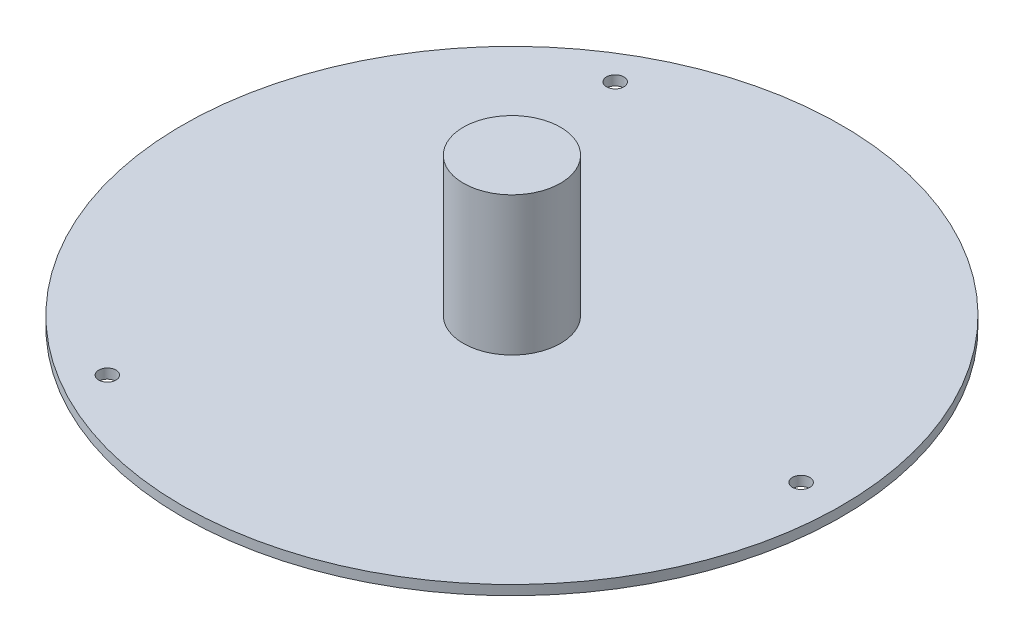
ISO-10303-21;
HEADER;
FILE_DESCRIPTION(('STEP AP214'),'2;1');
FILE_NAME('part.step','',(''),(''),'','','');
FILE_SCHEMA(('AUTOMOTIVE_DESIGN { 1 0 10303 214 1 1 1 1 }'));
ENDSEC;
DATA;
#1=APPLICATION_CONTEXT('core data for automotive mechanical design processes');
#2=APPLICATION_PROTOCOL_DEFINITION('international standard','automotive_design',2000,#1);
#3=PRODUCT_CONTEXT('',#1,'mechanical');
#4=PRODUCT('Part','Part','',(#3));
#5=PRODUCT_RELATED_PRODUCT_CATEGORY('part','',(#4));
#6=PRODUCT_DEFINITION_FORMATION('','',#4);
#7=PRODUCT_DEFINITION_CONTEXT('part definition',#1,'design');
#8=PRODUCT_DEFINITION('design','',#6,#7);
#9=PRODUCT_DEFINITION_SHAPE('','',#8);
#10=(LENGTH_UNIT() NAMED_UNIT(*) SI_UNIT(.MILLI.,.METRE.));
#11=(NAMED_UNIT(*) PLANE_ANGLE_UNIT() SI_UNIT($,.RADIAN.));
#12=(NAMED_UNIT(*) SI_UNIT($,.STERADIAN.) SOLID_ANGLE_UNIT());
#13=UNCERTAINTY_MEASURE_WITH_UNIT(LENGTH_MEASURE(1.E-05),#10,'distance_accuracy_value','');
#14=(GEOMETRIC_REPRESENTATION_CONTEXT(3) GLOBAL_UNCERTAINTY_ASSIGNED_CONTEXT((#13)) GLOBAL_UNIT_ASSIGNED_CONTEXT((#10,
#11,#12)) REPRESENTATION_CONTEXT('',''));
#15=CARTESIAN_POINT('',(0.,0.,0.));
#16=DIRECTION('',(0.,0.,1.));
#17=DIRECTION('',(1.,0.,0.));
#18=AXIS2_PLACEMENT_3D('',#15,#16,#17);
#19=CARTESIAN_POINT('',(0.,1.778,0.));
#20=DIRECTION('',(0.,1.,0.));
#21=DIRECTION('',(0.,0.,1.));
#22=AXIS2_PLACEMENT_3D('',#19,#20,#21);
#23=PLANE('',#22);
#24=CARTESIAN_POINT('',(0.,1.778,0.));
#25=DIRECTION('',(0.,1.,0.));
#26=DIRECTION('',(0.,0.,1.));
#27=AXIS2_PLACEMENT_3D('',#24,#25,#26);
#28=CIRCLE('',#27,60.325);
#29=CARTESIAN_POINT('',(0.,1.778,60.325));
#30=VERTEX_POINT('',#29);
#31=EDGE_CURVE('E10',#30,#30,#28,.T.);
#32=ORIENTED_EDGE('',*,*,#31,.T.);
#33=EDGE_LOOP('',(#32));
#34=FACE_BOUND('',#33,.T.);
#35=CARTESIAN_POINT('',(52.9345433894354,1.778,0.));
#36=DIRECTION('',(0.,1.,0.));
#37=DIRECTION('',(0.,0.,1.));
#38=AXIS2_PLACEMENT_3D('',#35,#36,#37);
#39=CIRCLE('',#38,1.5875);
#40=CARTESIAN_POINT('',(52.9345433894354,1.778,1.58749999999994));
#41=VERTEX_POINT('',#40);
#42=EDGE_CURVE('E43',#41,#41,#39,.T.);
#43=ORIENTED_EDGE('',*,*,#42,.F.);
#44=EDGE_LOOP('',(#43));
#45=FACE_BOUND('',#44,.T.);
#46=CARTESIAN_POINT('',(-27.574642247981,1.778,-46.482));
#47=DIRECTION('',(0.,1.,0.));
#48=DIRECTION('',(0.,0.,1.));
#49=AXIS2_PLACEMENT_3D('',#46,#47,#48);
#50=CIRCLE('',#49,1.5875);
#51=CARTESIAN_POINT('',(-27.574642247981,1.778,-44.8945));
#52=VERTEX_POINT('',#51);
#53=EDGE_CURVE('E49',#52,#52,#50,.T.);
#54=ORIENTED_EDGE('',*,*,#53,.F.);
#55=EDGE_LOOP('',(#54));
#56=FACE_BOUND('',#55,.T.);
#57=CARTESIAN_POINT('',(-27.574642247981,1.778,46.482));
#58=DIRECTION('',(0.,1.,0.));
#59=DIRECTION('',(0.,0.,1.));
#60=AXIS2_PLACEMENT_3D('',#57,#58,#59);
#61=CIRCLE('',#60,1.5875);
#62=CARTESIAN_POINT('',(-27.574642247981,1.778,48.0695));
#63=VERTEX_POINT('',#62);
#64=EDGE_CURVE('E55',#63,#63,#61,.T.);
#65=ORIENTED_EDGE('',*,*,#64,.F.);
#66=EDGE_LOOP('',(#65));
#67=FACE_BOUND('',#66,.T.);
#68=CARTESIAN_POINT('',(0.,1.778,0.));
#69=DIRECTION('',(0.,1.,0.));
#70=DIRECTION('',(0.,0.,1.));
#71=AXIS2_PLACEMENT_3D('',#68,#69,#70);
#72=CIRCLE('',#71,8.89);
#73=CARTESIAN_POINT('',(0.,1.778,8.89));
#74=VERTEX_POINT('',#73);
#75=EDGE_CURVE('E61',#74,#74,#72,.T.);
#76=ORIENTED_EDGE('',*,*,#75,.F.);
#77=EDGE_LOOP('',(#76));
#78=FACE_BOUND('',#77,.T.);
#79=ADVANCED_FACE('F30',(#34,#45,#56,#67,#78),#23,.T.);
#80=CARTESIAN_POINT('',(0.,1.778,0.));
#81=DIRECTION('',(0.,-1.,0.));
#82=DIRECTION('',(0.,0.,-1.));
#83=AXIS2_PLACEMENT_3D('',#80,#81,#82);
#84=CYLINDRICAL_SURFACE('',#83,60.325);
#85=ORIENTED_EDGE('',*,*,#31,.F.);
#86=EDGE_LOOP('',(#85));
#87=FACE_BOUND('',#86,.T.);
#88=CARTESIAN_POINT('',(0.,0.,0.));
#89=DIRECTION('',(0.,1.,0.));
#90=DIRECTION('',(0.,0.,1.));
#91=AXIS2_PLACEMENT_3D('',#88,#89,#90);
#92=CIRCLE('',#91,60.325);
#93=CARTESIAN_POINT('',(0.,0.,60.325));
#94=VERTEX_POINT('',#93);
#95=EDGE_CURVE('E34',#94,#94,#92,.T.);
#96=ORIENTED_EDGE('',*,*,#95,.T.);
#97=EDGE_LOOP('',(#96));
#98=FACE_BOUND('',#97,.T.);
#99=ADVANCED_FACE('F32',(#87,#98),#84,.T.);
#100=CARTESIAN_POINT('',(0.,0.,0.));
#101=DIRECTION('',(0.,1.,0.));
#102=DIRECTION('',(0.,0.,1.));
#103=AXIS2_PLACEMENT_3D('',#100,#101,#102);
#104=PLANE('',#103);
#105=CARTESIAN_POINT('',(-27.574642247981,0.,46.482));
#106=DIRECTION('',(0.,1.,0.));
#107=DIRECTION('',(0.,0.,1.));
#108=AXIS2_PLACEMENT_3D('',#105,#106,#107);
#109=CIRCLE('',#108,1.5875);
#110=CARTESIAN_POINT('',(-27.574642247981,0.,48.0695));
#111=VERTEX_POINT('',#110);
#112=EDGE_CURVE('E52',#111,#111,#109,.T.);
#113=ORIENTED_EDGE('',*,*,#112,.T.);
#114=EDGE_LOOP('',(#113));
#115=FACE_BOUND('',#114,.T.);
#116=CARTESIAN_POINT('',(-27.574642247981,0.,-46.482));
#117=DIRECTION('',(0.,1.,0.));
#118=DIRECTION('',(0.,0.,1.));
#119=AXIS2_PLACEMENT_3D('',#116,#117,#118);
#120=CIRCLE('',#119,1.5875);
#121=CARTESIAN_POINT('',(-27.574642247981,0.,-44.8945));
#122=VERTEX_POINT('',#121);
#123=EDGE_CURVE('E46',#122,#122,#120,.T.);
#124=ORIENTED_EDGE('',*,*,#123,.T.);
#125=EDGE_LOOP('',(#124));
#126=FACE_BOUND('',#125,.T.);
#127=CARTESIAN_POINT('',(52.9345433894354,0.,0.));
#128=DIRECTION('',(0.,1.,0.));
#129=DIRECTION('',(0.,0.,1.));
#130=AXIS2_PLACEMENT_3D('',#127,#128,#129);
#131=CIRCLE('',#130,1.5875);
#132=CARTESIAN_POINT('',(52.9345433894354,0.,1.58749999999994));
#133=VERTEX_POINT('',#132);
#134=EDGE_CURVE('E41',#133,#133,#131,.T.);
#135=ORIENTED_EDGE('',*,*,#134,.T.);
#136=EDGE_LOOP('',(#135));
#137=FACE_BOUND('',#136,.T.);
#138=ORIENTED_EDGE('',*,*,#95,.F.);
#139=EDGE_LOOP('',(#138));
#140=FACE_BOUND('',#139,.T.);
#141=ADVANCED_FACE('F81',(#115,#126,#137,#140),#104,.F.);
#142=CARTESIAN_POINT('',(52.9345433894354,0.,0.));
#143=DIRECTION('',(0.,1.,0.));
#144=DIRECTION('',(0.,0.,1.));
#145=AXIS2_PLACEMENT_3D('',#142,#143,#144);
#146=CYLINDRICAL_SURFACE('',#145,1.5875);
#147=ORIENTED_EDGE('',*,*,#134,.F.);
#148=EDGE_LOOP('',(#147));
#149=FACE_BOUND('',#148,.T.);
#150=ORIENTED_EDGE('',*,*,#42,.T.);
#151=EDGE_LOOP('',(#150));
#152=FACE_BOUND('',#151,.T.);
#153=ADVANCED_FACE('F85',(#149,#152),#146,.F.);
#154=CARTESIAN_POINT('',(-27.574642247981,0.,-46.482));
#155=DIRECTION('',(0.,1.,0.));
#156=DIRECTION('',(0.,0.,1.));
#157=AXIS2_PLACEMENT_3D('',#154,#155,#156);
#158=CYLINDRICAL_SURFACE('',#157,1.5875);
#159=ORIENTED_EDGE('',*,*,#123,.F.);
#160=EDGE_LOOP('',(#159));
#161=FACE_BOUND('',#160,.T.);
#162=ORIENTED_EDGE('',*,*,#53,.T.);
#163=EDGE_LOOP('',(#162));
#164=FACE_BOUND('',#163,.T.);
#165=ADVANCED_FACE('F92',(#161,#164),#158,.F.);
#166=CARTESIAN_POINT('',(-27.574642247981,0.,46.482));
#167=DIRECTION('',(0.,1.,0.));
#168=DIRECTION('',(0.,0.,1.));
#169=AXIS2_PLACEMENT_3D('',#166,#167,#168);
#170=CYLINDRICAL_SURFACE('',#169,1.5875);
#171=ORIENTED_EDGE('',*,*,#112,.F.);
#172=EDGE_LOOP('',(#171));
#173=FACE_BOUND('',#172,.T.);
#174=ORIENTED_EDGE('',*,*,#64,.T.);
#175=EDGE_LOOP('',(#174));
#176=FACE_BOUND('',#175,.T.);
#177=ADVANCED_FACE('F72',(#173,#176),#170,.F.);
#178=CARTESIAN_POINT('',(0.,27.178,0.));
#179=DIRECTION('',(0.,-1.,0.));
#180=DIRECTION('',(0.,0.,-1.));
#181=AXIS2_PLACEMENT_3D('',#178,#179,#180);
#182=CYLINDRICAL_SURFACE('',#181,8.89);
#183=CARTESIAN_POINT('',(0.,27.178,0.));
#184=DIRECTION('',(0.,1.,0.));
#185=DIRECTION('',(0.,0.,1.));
#186=AXIS2_PLACEMENT_3D('',#183,#184,#185);
#187=CIRCLE('',#186,8.89);
#188=CARTESIAN_POINT('',(0.,27.178,8.89));
#189=VERTEX_POINT('',#188);
#190=EDGE_CURVE('E58',#189,#189,#187,.T.);
#191=ORIENTED_EDGE('',*,*,#190,.F.);
#192=EDGE_LOOP('',(#191));
#193=FACE_BOUND('',#192,.T.);
#194=ORIENTED_EDGE('',*,*,#75,.T.);
#195=EDGE_LOOP('',(#194));
#196=FACE_BOUND('',#195,.T.);
#197=ADVANCED_FACE('F69',(#193,#196),#182,.T.);
#198=CARTESIAN_POINT('',(0.,27.178,0.));
#199=DIRECTION('',(0.,1.,0.));
#200=DIRECTION('',(0.,0.,1.));
#201=AXIS2_PLACEMENT_3D('',#198,#199,#200);
#202=PLANE('',#201);
#203=ORIENTED_EDGE('',*,*,#190,.T.);
#204=EDGE_LOOP('',(#203));
#205=FACE_BOUND('',#204,.T.);
#206=ADVANCED_FACE('F67',(#205),#202,.T.);
#207=CLOSED_SHELL('',(#79,#99,#141,#153,#165,#177,#197,#206));
#208=MANIFOLD_SOLID_BREP('B2',#207);
#209=ADVANCED_BREP_SHAPE_REPRESENTATION('',(#18,#208),#14);
#210=SHAPE_DEFINITION_REPRESENTATION(#9,#209);
ENDSEC;
END-ISO-10303-21;
